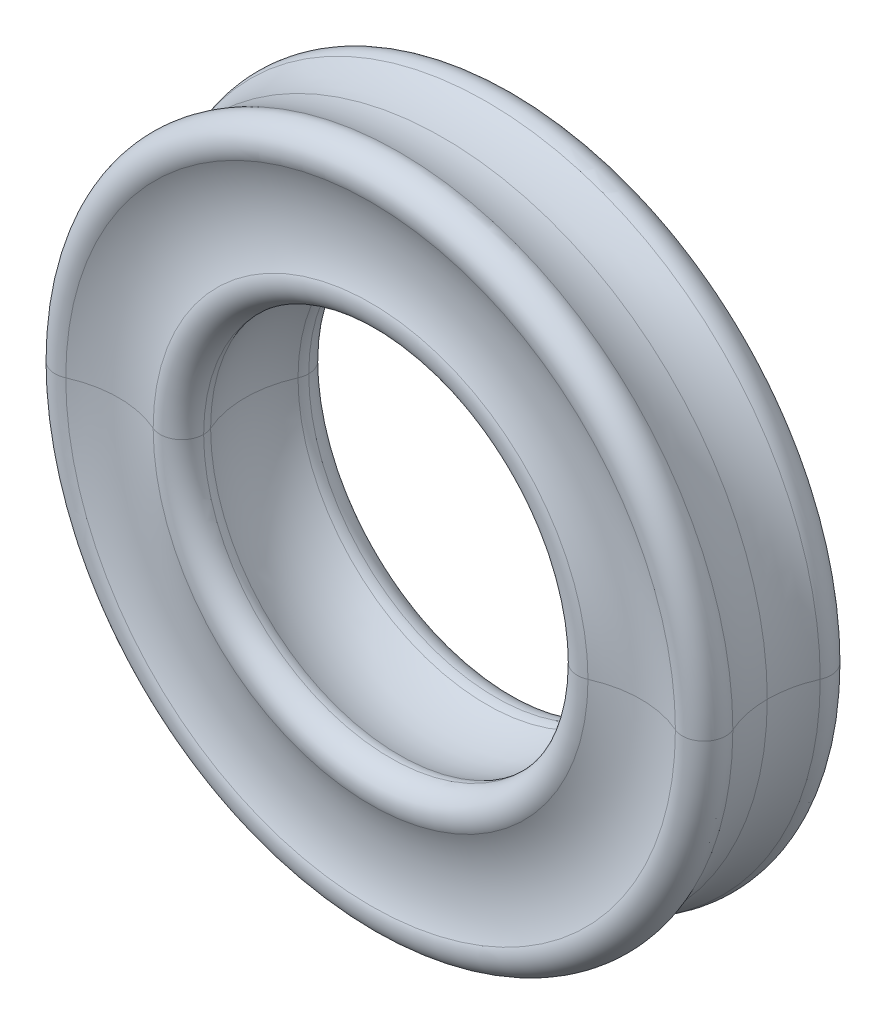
ISO-10303-21;
HEADER;
FILE_DESCRIPTION(('STEP AP214'),'2;1');
FILE_NAME('part.step','',(''),(''),'','','');
FILE_SCHEMA(('AUTOMOTIVE_DESIGN { 1 0 10303 214 1 1 1 1 }'));
ENDSEC;
DATA;
#1=APPLICATION_CONTEXT('core data for automotive mechanical design processes');
#2=APPLICATION_PROTOCOL_DEFINITION('international standard','automotive_design',2000,#1);
#3=PRODUCT_CONTEXT('',#1,'mechanical');
#4=PRODUCT('Part','Part','',(#3));
#5=PRODUCT_RELATED_PRODUCT_CATEGORY('part','',(#4));
#6=PRODUCT_DEFINITION_FORMATION('','',#4);
#7=PRODUCT_DEFINITION_CONTEXT('part definition',#1,'design');
#8=PRODUCT_DEFINITION('design','',#6,#7);
#9=PRODUCT_DEFINITION_SHAPE('','',#8);
#10=(LENGTH_UNIT() NAMED_UNIT(*) SI_UNIT(.MILLI.,.METRE.));
#11=(NAMED_UNIT(*) PLANE_ANGLE_UNIT() SI_UNIT($,.RADIAN.));
#12=(NAMED_UNIT(*) SI_UNIT($,.STERADIAN.) SOLID_ANGLE_UNIT());
#13=UNCERTAINTY_MEASURE_WITH_UNIT(LENGTH_MEASURE(1.E-05),#10,'distance_accuracy_value','');
#14=(GEOMETRIC_REPRESENTATION_CONTEXT(3) GLOBAL_UNCERTAINTY_ASSIGNED_CONTEXT((#13)) GLOBAL_UNIT_ASSIGNED_CONTEXT((#10,
#11,#12)) REPRESENTATION_CONTEXT('',''));
#15=CARTESIAN_POINT('',(0.,0.,0.));
#16=DIRECTION('',(0.,0.,1.));
#17=DIRECTION('',(1.,0.,0.));
#18=AXIS2_PLACEMENT_3D('',#15,#16,#17);
#19=CARTESIAN_POINT('',(0.,0.,-0.628617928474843));
#20=DIRECTION('',(0.,0.,1.));
#21=DIRECTION('',(1.,0.,0.));
#22=AXIS2_PLACEMENT_3D('',#19,#20,#21);
#23=TOROIDAL_SURFACE('',#22,2.49558207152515,0.260382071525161);
#24=CARTESIAN_POINT('',(0.,0.,-0.628617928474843));
#25=DIRECTION('',(0.,0.,1.));
#26=DIRECTION('',(1.,0.,0.));
#27=AXIS2_PLACEMENT_3D('',#24,#25,#26);
#28=CIRCLE('',#27,2.2352);
#29=CARTESIAN_POINT('',(-2.2352,0.,-0.628617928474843));
#30=VERTEX_POINT('',#29);
#31=CARTESIAN_POINT('',(2.2352,0.,-0.628617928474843));
#32=VERTEX_POINT('',#31);
#33=EDGE_CURVE('E193',#30,#32,#28,.T.);
#34=ORIENTED_EDGE('',*,*,#33,.F.);
#35=CARTESIAN_POINT('',(-2.49558207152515,0.,-0.628617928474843));
#36=DIRECTION('',(0.,1.,0.));
#37=DIRECTION('',(-1.,0.,0.));
#38=AXIS2_PLACEMENT_3D('',#35,#36,#37);
#39=CIRCLE('',#38,0.260382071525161);
#40=CARTESIAN_POINT('',(-2.25762525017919,0.,-0.522904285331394));
#41=VERTEX_POINT('',#40);
#42=EDGE_CURVE('E153',#41,#30,#39,.T.);
#43=ORIENTED_EDGE('',*,*,#42,.F.);
#44=CARTESIAN_POINT('',(0.,0.,-0.522904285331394));
#45=DIRECTION('',(0.,0.,1.));
#46=DIRECTION('',(1.,0.,0.));
#47=AXIS2_PLACEMENT_3D('',#44,#45,#46);
#48=CIRCLE('',#47,2.25762525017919);
#49=CARTESIAN_POINT('',(2.25762525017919,0.,-0.522904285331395));
#50=VERTEX_POINT('',#49);
#51=EDGE_CURVE('E147',#41,#50,#48,.T.);
#52=ORIENTED_EDGE('',*,*,#51,.T.);
#53=CARTESIAN_POINT('',(2.49558207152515,0.,-0.628617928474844));
#54=DIRECTION('',(0.,-1.,0.));
#55=DIRECTION('',(0.,0.,-1.));
#56=AXIS2_PLACEMENT_3D('',#53,#54,#55);
#57=CIRCLE('',#56,0.260382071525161);
#58=EDGE_CURVE('E154',#50,#32,#57,.T.);
#59=ORIENTED_EDGE('',*,*,#58,.T.);
#60=EDGE_LOOP('',(#34,#43,#52,#59));
#61=FACE_BOUND('',#60,.T.);
#62=ADVANCED_FACE('F16',(#61),#23,.T.);
#63=CARTESIAN_POINT('',(0.,0.,0.));
#64=DIRECTION('',(0.,0.,1.));
#65=DIRECTION('',(1.,0.,0.));
#66=AXIS2_PLACEMENT_3D('',#63,#64,#65);
#67=DEGENERATE_TOROIDAL_SURFACE('',#66,1.08059040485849,1.2879595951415,.T.);
#68=CARTESIAN_POINT('',(-1.08059040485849,0.,0.));
#69=DIRECTION('',(0.,1.,0.));
#70=DIRECTION('',(-1.,0.,0.));
#71=AXIS2_PLACEMENT_3D('',#68,#69,#70);
#72=CIRCLE('',#71,1.2879595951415);
#73=CARTESIAN_POINT('',(-2.25762525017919,0.,0.522904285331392));
#74=VERTEX_POINT('',#73);
#75=EDGE_CURVE('E102',#41,#74,#72,.T.);
#76=ORIENTED_EDGE('',*,*,#75,.F.);
#77=CARTESIAN_POINT('',(0.,0.,-0.522904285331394));
#78=DIRECTION('',(0.,0.,1.));
#79=DIRECTION('',(1.,0.,0.));
#80=AXIS2_PLACEMENT_3D('',#77,#78,#79);
#81=CIRCLE('',#80,2.25762525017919);
#82=EDGE_CURVE('E94',#50,#41,#81,.T.);
#83=ORIENTED_EDGE('',*,*,#82,.F.);
#84=CARTESIAN_POINT('',(1.08059040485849,0.,0.));
#85=DIRECTION('',(0.,-1.,0.));
#86=DIRECTION('',(0.,0.,-1.));
#87=AXIS2_PLACEMENT_3D('',#84,#85,#86);
#88=CIRCLE('',#87,1.2879595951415);
#89=CARTESIAN_POINT('',(2.25762525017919,0.,0.522904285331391));
#90=VERTEX_POINT('',#89);
#91=EDGE_CURVE('E87',#50,#90,#88,.T.);
#92=ORIENTED_EDGE('',*,*,#91,.T.);
#93=CARTESIAN_POINT('',(0.,0.,0.522904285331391));
#94=DIRECTION('',(0.,0.,1.));
#95=DIRECTION('',(1.,0.,0.));
#96=AXIS2_PLACEMENT_3D('',#93,#94,#95);
#97=CIRCLE('',#96,2.25762525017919);
#98=EDGE_CURVE('E91',#90,#74,#97,.T.);
#99=ORIENTED_EDGE('',*,*,#98,.T.);
#100=EDGE_LOOP('',(#76,#83,#92,#99));
#101=FACE_BOUND('',#100,.T.);
#102=ADVANCED_FACE('F90',(#101),#67,.F.);
#103=CARTESIAN_POINT('',(0.,0.,0.628617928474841));
#104=DIRECTION('',(0.,0.,1.));
#105=DIRECTION('',(1.,0.,0.));
#106=AXIS2_PLACEMENT_3D('',#103,#104,#105);
#107=TOROIDAL_SURFACE('',#106,2.49558207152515,0.260382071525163);
#108=CARTESIAN_POINT('',(0.,0.,0.628617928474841));
#109=DIRECTION('',(0.,0.,1.));
#110=DIRECTION('',(1.,0.,0.));
#111=AXIS2_PLACEMENT_3D('',#108,#109,#110);
#112=CIRCLE('',#111,2.2352);
#113=CARTESIAN_POINT('',(-2.2352,0.,0.628617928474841));
#114=VERTEX_POINT('',#113);
#115=CARTESIAN_POINT('',(2.2352,0.,0.628617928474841));
#116=VERTEX_POINT('',#115);
#117=EDGE_CURVE('E127',#114,#116,#112,.T.);
#118=ORIENTED_EDGE('',*,*,#117,.F.);
#119=CARTESIAN_POINT('',(-2.49558207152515,0.,0.628617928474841));
#120=DIRECTION('',(0.,1.,0.));
#121=DIRECTION('',(-1.,0.,0.));
#122=AXIS2_PLACEMENT_3D('',#119,#120,#121);
#123=CIRCLE('',#122,0.260382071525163);
#124=CARTESIAN_POINT('',(-2.6012957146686,0.,0.866574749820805));
#125=VERTEX_POINT('',#124);
#126=EDGE_CURVE('E20',#125,#114,#123,.T.);
#127=ORIENTED_EDGE('',*,*,#126,.F.);
#128=CARTESIAN_POINT('',(0.,0.,0.866574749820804));
#129=DIRECTION('',(0.,0.,1.));
#130=DIRECTION('',(1.,0.,0.));
#131=AXIS2_PLACEMENT_3D('',#128,#129,#130);
#132=CIRCLE('',#131,2.6012957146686);
#133=CARTESIAN_POINT('',(2.6012957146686,0.,0.866574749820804));
#134=VERTEX_POINT('',#133);
#135=EDGE_CURVE('E138',#125,#134,#132,.T.);
#136=ORIENTED_EDGE('',*,*,#135,.T.);
#137=CARTESIAN_POINT('',(2.49558207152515,0.,0.62861792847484));
#138=DIRECTION('',(0.,-1.,0.));
#139=DIRECTION('',(0.,0.,-1.));
#140=AXIS2_PLACEMENT_3D('',#137,#138,#139);
#141=CIRCLE('',#140,0.260382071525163);
#142=EDGE_CURVE('E101',#134,#116,#141,.T.);
#143=ORIENTED_EDGE('',*,*,#142,.T.);
#144=EDGE_LOOP('',(#118,#127,#136,#143));
#145=FACE_BOUND('',#144,.T.);
#146=ADVANCED_FACE('F267',(#145),#107,.T.);
#147=CARTESIAN_POINT('',(0.,0.,2.0436095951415));
#148=DIRECTION('',(0.,0.,1.));
#149=DIRECTION('',(1.,0.,0.));
#150=AXIS2_PLACEMENT_3D('',#147,#148,#149);
#151=TOROIDAL_SURFACE('',#150,3.1242,1.2879595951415);
#152=CARTESIAN_POINT('',(-3.1242,0.,2.0436095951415));
#153=DIRECTION('',(0.,1.,0.));
#154=DIRECTION('',(-1.,0.,0.));
#155=AXIS2_PLACEMENT_3D('',#152,#153,#154);
#156=CIRCLE('',#155,1.2879595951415);
#157=CARTESIAN_POINT('',(-3.64710428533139,0.,0.866574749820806));
#158=VERTEX_POINT('',#157);
#159=EDGE_CURVE('E184',#125,#158,#156,.T.);
#160=ORIENTED_EDGE('',*,*,#159,.F.);
#161=CARTESIAN_POINT('',(0.,0.,0.866574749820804));
#162=DIRECTION('',(0.,0.,1.));
#163=DIRECTION('',(1.,0.,0.));
#164=AXIS2_PLACEMENT_3D('',#161,#162,#163);
#165=CIRCLE('',#164,2.6012957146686);
#166=EDGE_CURVE('E169',#134,#125,#165,.T.);
#167=ORIENTED_EDGE('',*,*,#166,.F.);
#168=CARTESIAN_POINT('',(3.1242,0.,2.0436095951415));
#169=DIRECTION('',(0.,-1.,0.));
#170=DIRECTION('',(0.,0.,-1.));
#171=AXIS2_PLACEMENT_3D('',#168,#169,#170);
#172=CIRCLE('',#171,1.2879595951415);
#173=CARTESIAN_POINT('',(3.64710428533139,0.,0.866574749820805));
#174=VERTEX_POINT('',#173);
#175=EDGE_CURVE('E144',#134,#174,#172,.T.);
#176=ORIENTED_EDGE('',*,*,#175,.T.);
#177=CARTESIAN_POINT('',(0.,0.,0.866574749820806));
#178=DIRECTION('',(0.,0.,1.));
#179=DIRECTION('',(1.,0.,0.));
#180=AXIS2_PLACEMENT_3D('',#177,#178,#179);
#181=CIRCLE('',#180,3.64710428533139);
#182=EDGE_CURVE('E143',#174,#158,#181,.T.);
#183=ORIENTED_EDGE('',*,*,#182,.T.);
#184=EDGE_LOOP('',(#160,#167,#176,#183));
#185=FACE_BOUND('',#184,.T.);
#186=ADVANCED_FACE('F276',(#185),#151,.F.);
#187=CARTESIAN_POINT('',(0.,0.,0.628617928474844));
#188=DIRECTION('',(0.,0.,1.));
#189=DIRECTION('',(1.,0.,0.));
#190=AXIS2_PLACEMENT_3D('',#187,#188,#189);
#191=TOROIDAL_SURFACE('',#190,3.75281792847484,0.260382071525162);
#192=CARTESIAN_POINT('',(-3.75281792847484,0.,0.628617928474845));
#193=DIRECTION('',(0.,1.,0.));
#194=DIRECTION('',(-1.,0.,0.));
#195=AXIS2_PLACEMENT_3D('',#192,#193,#194);
#196=CIRCLE('',#195,0.260382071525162);
#197=CARTESIAN_POINT('',(-3.9907747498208,0.,0.522904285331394));
#198=VERTEX_POINT('',#197);
#199=EDGE_CURVE('E140',#198,#158,#196,.T.);
#200=ORIENTED_EDGE('',*,*,#199,.F.);
#201=CARTESIAN_POINT('',(0.,0.,0.522904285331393));
#202=DIRECTION('',(0.,0.,1.));
#203=DIRECTION('',(1.,0.,0.));
#204=AXIS2_PLACEMENT_3D('',#201,#202,#203);
#205=CIRCLE('',#204,3.9907747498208);
#206=CARTESIAN_POINT('',(3.9907747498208,0.,0.522904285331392));
#207=VERTEX_POINT('',#206);
#208=EDGE_CURVE('E170',#198,#207,#205,.T.);
#209=ORIENTED_EDGE('',*,*,#208,.T.);
#210=CARTESIAN_POINT('',(3.75281792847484,0.,0.628617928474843));
#211=DIRECTION('',(0.,-1.,0.));
#212=DIRECTION('',(0.,0.,-1.));
#213=AXIS2_PLACEMENT_3D('',#210,#211,#212);
#214=CIRCLE('',#213,0.260382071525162);
#215=EDGE_CURVE('E148',#207,#174,#214,.T.);
#216=ORIENTED_EDGE('',*,*,#215,.T.);
#217=CARTESIAN_POINT('',(0.,0.,0.866574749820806));
#218=DIRECTION('',(0.,0.,1.));
#219=DIRECTION('',(1.,0.,0.));
#220=AXIS2_PLACEMENT_3D('',#217,#218,#219);
#221=CIRCLE('',#220,3.64710428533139);
#222=EDGE_CURVE('E180',#158,#174,#221,.T.);
#223=ORIENTED_EDGE('',*,*,#222,.F.);
#224=EDGE_LOOP('',(#200,#209,#216,#223));
#225=FACE_BOUND('',#224,.T.);
#226=ADVANCED_FACE('F446',(#225),#191,.T.);
#227=CARTESIAN_POINT('',(0.,0.,0.));
#228=DIRECTION('',(0.,0.,1.));
#229=DIRECTION('',(1.,0.,0.));
#230=AXIS2_PLACEMENT_3D('',#227,#228,#229);
#231=TOROIDAL_SURFACE('',#230,5.1678095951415,1.2879595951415);
#232=CARTESIAN_POINT('',(0.,0.,0.));
#233=DIRECTION('',(0.,0.,1.));
#234=DIRECTION('',(1.,0.,0.));
#235=AXIS2_PLACEMENT_3D('',#232,#233,#234);
#236=CIRCLE('',#235,3.87985);
#237=CARTESIAN_POINT('',(3.87985,0.,0.));
#238=VERTEX_POINT('',#237);
#239=CARTESIAN_POINT('',(-3.87985,0.,0.));
#240=VERTEX_POINT('',#239);
#241=EDGE_CURVE('E161',#238,#240,#236,.T.);
#242=ORIENTED_EDGE('',*,*,#241,.F.);
#243=CARTESIAN_POINT('',(5.1678095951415,0.,0.));
#244=DIRECTION('',(0.,-1.,0.));
#245=DIRECTION('',(0.,0.,-1.));
#246=AXIS2_PLACEMENT_3D('',#243,#244,#245);
#247=CIRCLE('',#246,1.2879595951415);
#248=CARTESIAN_POINT('',(3.9907747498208,0.,-0.522904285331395));
#249=VERTEX_POINT('',#248);
#250=EDGE_CURVE('E166',#238,#249,#247,.T.);
#251=ORIENTED_EDGE('',*,*,#250,.T.);
#252=CARTESIAN_POINT('',(0.,0.,-0.522904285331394));
#253=DIRECTION('',(0.,0.,1.));
#254=DIRECTION('',(1.,0.,0.));
#255=AXIS2_PLACEMENT_3D('',#252,#253,#254);
#256=CIRCLE('',#255,3.9907747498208);
#257=CARTESIAN_POINT('',(-3.9907747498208,0.,-0.522904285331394));
#258=VERTEX_POINT('',#257);
#259=EDGE_CURVE('E213',#249,#258,#256,.T.);
#260=ORIENTED_EDGE('',*,*,#259,.T.);
#261=CARTESIAN_POINT('',(-5.1678095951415,0.,0.));
#262=DIRECTION('',(0.,1.,0.));
#263=DIRECTION('',(-1.,0.,0.));
#264=AXIS2_PLACEMENT_3D('',#261,#262,#263);
#265=CIRCLE('',#264,1.2879595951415);
#266=EDGE_CURVE('E151',#240,#258,#265,.T.);
#267=ORIENTED_EDGE('',*,*,#266,.F.);
#268=EDGE_LOOP('',(#242,#251,#260,#267));
#269=FACE_BOUND('',#268,.T.);
#270=ADVANCED_FACE('F18',(#269),#231,.F.);
#271=CARTESIAN_POINT('',(0.,0.,-0.628617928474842));
#272=DIRECTION('',(0.,0.,1.));
#273=DIRECTION('',(1.,0.,0.));
#274=AXIS2_PLACEMENT_3D('',#271,#272,#273);
#275=TOROIDAL_SURFACE('',#274,3.75281792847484,0.260382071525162);
#276=CARTESIAN_POINT('',(-3.75281792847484,0.,-0.628617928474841));
#277=DIRECTION('',(0.,1.,0.));
#278=DIRECTION('',(-1.,0.,0.));
#279=AXIS2_PLACEMENT_3D('',#276,#277,#278);
#280=CIRCLE('',#279,0.260382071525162);
#281=CARTESIAN_POINT('',(-3.64710428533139,0.,-0.866574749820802));
#282=VERTEX_POINT('',#281);
#283=EDGE_CURVE('E217',#282,#258,#280,.T.);
#284=ORIENTED_EDGE('',*,*,#283,.F.);
#285=CARTESIAN_POINT('',(0.,0.,-0.866574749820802));
#286=DIRECTION('',(0.,0.,1.));
#287=DIRECTION('',(1.,0.,0.));
#288=AXIS2_PLACEMENT_3D('',#285,#286,#287);
#289=CIRCLE('',#288,3.64710428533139);
#290=CARTESIAN_POINT('',(3.64710428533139,0.,-0.866574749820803));
#291=VERTEX_POINT('',#290);
#292=EDGE_CURVE('E212',#282,#291,#289,.T.);
#293=ORIENTED_EDGE('',*,*,#292,.T.);
#294=CARTESIAN_POINT('',(3.75281792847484,0.,-0.628617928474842));
#295=DIRECTION('',(0.,-1.,0.));
#296=DIRECTION('',(0.,0.,-1.));
#297=AXIS2_PLACEMENT_3D('',#294,#295,#296);
#298=CIRCLE('',#297,0.260382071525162);
#299=EDGE_CURVE('E208',#291,#249,#298,.T.);
#300=ORIENTED_EDGE('',*,*,#299,.T.);
#301=CARTESIAN_POINT('',(0.,0.,-0.522904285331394));
#302=DIRECTION('',(0.,0.,1.));
#303=DIRECTION('',(1.,0.,0.));
#304=AXIS2_PLACEMENT_3D('',#301,#302,#303);
#305=CIRCLE('',#304,3.9907747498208);
#306=EDGE_CURVE('E162',#258,#249,#305,.T.);
#307=ORIENTED_EDGE('',*,*,#306,.F.);
#308=EDGE_LOOP('',(#284,#293,#300,#307));
#309=FACE_BOUND('',#308,.T.);
#310=ADVANCED_FACE('F305',(#309),#275,.T.);
#311=CARTESIAN_POINT('',(0.,0.,-2.0436095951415));
#312=DIRECTION('',(0.,0.,1.));
#313=DIRECTION('',(1.,0.,0.));
#314=AXIS2_PLACEMENT_3D('',#311,#312,#313);
#315=TOROIDAL_SURFACE('',#314,3.1242,1.2879595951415);
#316=CARTESIAN_POINT('',(-3.1242,0.,-2.0436095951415));
#317=DIRECTION('',(0.,1.,0.));
#318=DIRECTION('',(-1.,0.,0.));
#319=AXIS2_PLACEMENT_3D('',#316,#317,#318);
#320=CIRCLE('',#319,1.2879595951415);
#321=CARTESIAN_POINT('',(-2.60129571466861,0.,-0.866574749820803));
#322=VERTEX_POINT('',#321);
#323=EDGE_CURVE('E27',#282,#322,#320,.T.);
#324=ORIENTED_EDGE('',*,*,#323,.F.);
#325=CARTESIAN_POINT('',(0.,0.,-0.866574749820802));
#326=DIRECTION('',(0.,0.,1.));
#327=DIRECTION('',(1.,0.,0.));
#328=AXIS2_PLACEMENT_3D('',#325,#326,#327);
#329=CIRCLE('',#328,3.64710428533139);
#330=EDGE_CURVE('E192',#291,#282,#329,.T.);
#331=ORIENTED_EDGE('',*,*,#330,.F.);
#332=CARTESIAN_POINT('',(3.1242,0.,-2.0436095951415));
#333=DIRECTION('',(0.,-1.,0.));
#334=DIRECTION('',(0.,0.,-1.));
#335=AXIS2_PLACEMENT_3D('',#332,#333,#334);
#336=CIRCLE('',#335,1.2879595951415);
#337=CARTESIAN_POINT('',(2.60129571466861,0.,-0.866574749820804));
#338=VERTEX_POINT('',#337);
#339=EDGE_CURVE('E11',#291,#338,#336,.T.);
#340=ORIENTED_EDGE('',*,*,#339,.T.);
#341=CARTESIAN_POINT('',(0.,0.,-0.866574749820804));
#342=DIRECTION('',(0.,0.,1.));
#343=DIRECTION('',(1.,0.,0.));
#344=AXIS2_PLACEMENT_3D('',#341,#342,#343);
#345=CIRCLE('',#344,2.60129571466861);
#346=EDGE_CURVE('E188',#338,#322,#345,.T.);
#347=ORIENTED_EDGE('',*,*,#346,.T.);
#348=EDGE_LOOP('',(#324,#331,#340,#347));
#349=FACE_BOUND('',#348,.T.);
#350=ADVANCED_FACE('F340',(#349),#315,.F.);
#351=CARTESIAN_POINT('',(0.,0.,-2.0436095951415));
#352=DIRECTION('',(0.,0.,1.));
#353=DIRECTION('',(1.,0.,0.));
#354=AXIS2_PLACEMENT_3D('',#351,#352,#353);
#355=TOROIDAL_SURFACE('',#354,3.1242,1.2879595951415);
#356=ORIENTED_EDGE('',*,*,#292,.F.);
#357=ORIENTED_EDGE('',*,*,#323,.T.);
#358=CARTESIAN_POINT('',(0.,0.,-0.866574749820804));
#359=DIRECTION('',(0.,0.,1.));
#360=DIRECTION('',(1.,0.,0.));
#361=AXIS2_PLACEMENT_3D('',#358,#359,#360);
#362=CIRCLE('',#361,2.60129571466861);
#363=EDGE_CURVE('E221',#322,#338,#362,.T.);
#364=ORIENTED_EDGE('',*,*,#363,.T.);
#365=ORIENTED_EDGE('',*,*,#339,.F.);
#366=EDGE_LOOP('',(#356,#357,#364,#365));
#367=FACE_BOUND('',#366,.T.);
#368=ADVANCED_FACE('F333',(#367),#355,.F.);
#369=CARTESIAN_POINT('',(0.,0.,-0.628617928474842));
#370=DIRECTION('',(0.,0.,1.));
#371=DIRECTION('',(1.,0.,0.));
#372=AXIS2_PLACEMENT_3D('',#369,#370,#371);
#373=TOROIDAL_SURFACE('',#372,3.75281792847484,0.260382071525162);
#374=ORIENTED_EDGE('',*,*,#330,.T.);
#375=ORIENTED_EDGE('',*,*,#283,.T.);
#376=ORIENTED_EDGE('',*,*,#259,.F.);
#377=ORIENTED_EDGE('',*,*,#299,.F.);
#378=EDGE_LOOP('',(#374,#375,#376,#377));
#379=FACE_BOUND('',#378,.T.);
#380=ADVANCED_FACE('F302',(#379),#373,.T.);
#381=CARTESIAN_POINT('',(0.,0.,0.));
#382=DIRECTION('',(0.,0.,1.));
#383=DIRECTION('',(1.,0.,0.));
#384=AXIS2_PLACEMENT_3D('',#381,#382,#383);
#385=TOROIDAL_SURFACE('',#384,5.1678095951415,1.2879595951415);
#386=CARTESIAN_POINT('',(0.,0.,0.));
#387=DIRECTION('',(0.,0.,1.));
#388=DIRECTION('',(1.,0.,0.));
#389=AXIS2_PLACEMENT_3D('',#386,#387,#388);
#390=CIRCLE('',#389,3.87985);
#391=EDGE_CURVE('E174',#240,#238,#390,.T.);
#392=ORIENTED_EDGE('',*,*,#391,.F.);
#393=ORIENTED_EDGE('',*,*,#266,.T.);
#394=ORIENTED_EDGE('',*,*,#306,.T.);
#395=ORIENTED_EDGE('',*,*,#250,.F.);
#396=EDGE_LOOP('',(#392,#393,#394,#395));
#397=FACE_BOUND('',#396,.T.);
#398=ADVANCED_FACE('F307',(#397),#385,.F.);
#399=CARTESIAN_POINT('',(0.,0.,0.628617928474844));
#400=DIRECTION('',(0.,0.,1.));
#401=DIRECTION('',(1.,0.,0.));
#402=AXIS2_PLACEMENT_3D('',#399,#400,#401);
#403=TOROIDAL_SURFACE('',#402,3.75281792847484,0.260382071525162);
#404=CARTESIAN_POINT('',(0.,0.,0.522904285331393));
#405=DIRECTION('',(0.,0.,1.));
#406=DIRECTION('',(1.,0.,0.));
#407=AXIS2_PLACEMENT_3D('',#404,#405,#406);
#408=CIRCLE('',#407,3.9907747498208);
#409=EDGE_CURVE('E160',#207,#198,#408,.T.);
#410=ORIENTED_EDGE('',*,*,#409,.T.);
#411=ORIENTED_EDGE('',*,*,#199,.T.);
#412=ORIENTED_EDGE('',*,*,#182,.F.);
#413=ORIENTED_EDGE('',*,*,#215,.F.);
#414=EDGE_LOOP('',(#410,#411,#412,#413));
#415=FACE_BOUND('',#414,.T.);
#416=ADVANCED_FACE('F444',(#415),#403,.T.);
#417=CARTESIAN_POINT('',(0.,0.,2.0436095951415));
#418=DIRECTION('',(0.,0.,1.));
#419=DIRECTION('',(1.,0.,0.));
#420=AXIS2_PLACEMENT_3D('',#417,#418,#419);
#421=TOROIDAL_SURFACE('',#420,3.1242,1.2879595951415);
#422=ORIENTED_EDGE('',*,*,#135,.F.);
#423=ORIENTED_EDGE('',*,*,#159,.T.);
#424=ORIENTED_EDGE('',*,*,#222,.T.);
#425=ORIENTED_EDGE('',*,*,#175,.F.);
#426=EDGE_LOOP('',(#422,#423,#424,#425));
#427=FACE_BOUND('',#426,.T.);
#428=ADVANCED_FACE('F447',(#427),#421,.F.);
#429=CARTESIAN_POINT('',(0.,0.,0.628617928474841));
#430=DIRECTION('',(0.,0.,1.));
#431=DIRECTION('',(1.,0.,0.));
#432=AXIS2_PLACEMENT_3D('',#429,#430,#431);
#433=TOROIDAL_SURFACE('',#432,2.49558207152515,0.260382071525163);
#434=CARTESIAN_POINT('',(0.,0.,0.628617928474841));
#435=DIRECTION('',(0.,0.,1.));
#436=DIRECTION('',(1.,0.,0.));
#437=AXIS2_PLACEMENT_3D('',#434,#435,#436);
#438=CIRCLE('',#437,2.2352);
#439=EDGE_CURVE('E116',#116,#114,#438,.T.);
#440=ORIENTED_EDGE('',*,*,#439,.F.);
#441=ORIENTED_EDGE('',*,*,#142,.F.);
#442=ORIENTED_EDGE('',*,*,#166,.T.);
#443=ORIENTED_EDGE('',*,*,#126,.T.);
#444=EDGE_LOOP('',(#440,#441,#442,#443));
#445=FACE_BOUND('',#444,.T.);
#446=ADVANCED_FACE('F277',(#445),#433,.T.);
#447=CARTESIAN_POINT('',(0.,0.,0.));
#448=DIRECTION('',(0.,0.,1.));
#449=DIRECTION('',(1.,0.,0.));
#450=AXIS2_PLACEMENT_3D('',#447,#448,#449);
#451=DEGENERATE_TOROIDAL_SURFACE('',#450,1.08059040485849,1.2879595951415,.T.);
#452=ORIENTED_EDGE('',*,*,#51,.F.);
#453=ORIENTED_EDGE('',*,*,#75,.T.);
#454=CARTESIAN_POINT('',(0.,0.,0.522904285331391));
#455=DIRECTION('',(0.,0.,1.));
#456=DIRECTION('',(1.,0.,0.));
#457=AXIS2_PLACEMENT_3D('',#454,#455,#456);
#458=CIRCLE('',#457,2.25762525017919);
#459=EDGE_CURVE('E119',#74,#90,#458,.T.);
#460=ORIENTED_EDGE('',*,*,#459,.T.);
#461=ORIENTED_EDGE('',*,*,#91,.F.);
#462=EDGE_LOOP('',(#452,#453,#460,#461));
#463=FACE_BOUND('',#462,.T.);
#464=ADVANCED_FACE('F120',(#463),#451,.F.);
#465=CARTESIAN_POINT('',(0.,0.,-0.628617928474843));
#466=DIRECTION('',(0.,0.,1.));
#467=DIRECTION('',(1.,0.,0.));
#468=AXIS2_PLACEMENT_3D('',#465,#466,#467);
#469=TOROIDAL_SURFACE('',#468,2.49558207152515,0.260382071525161);
#470=CARTESIAN_POINT('',(0.,0.,-0.628617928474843));
#471=DIRECTION('',(0.,0.,1.));
#472=DIRECTION('',(1.,0.,0.));
#473=AXIS2_PLACEMENT_3D('',#470,#471,#472);
#474=CIRCLE('',#473,2.2352);
#475=EDGE_CURVE('E115',#32,#30,#474,.T.);
#476=ORIENTED_EDGE('',*,*,#475,.F.);
#477=ORIENTED_EDGE('',*,*,#58,.F.);
#478=ORIENTED_EDGE('',*,*,#82,.T.);
#479=ORIENTED_EDGE('',*,*,#42,.T.);
#480=EDGE_LOOP('',(#476,#477,#478,#479));
#481=FACE_BOUND('',#480,.T.);
#482=ADVANCED_FACE('F466',(#481),#469,.T.);
#483=CARTESIAN_POINT('',(0.,0.,-0.628617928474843));
#484=DIRECTION('',(0.,0.,1.));
#485=DIRECTION('',(1.,0.,0.));
#486=AXIS2_PLACEMENT_3D('',#483,#484,#485);
#487=TOROIDAL_SURFACE('',#486,2.49558207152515,0.260382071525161);
#488=CARTESIAN_POINT('',(2.49558207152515,0.,-0.628617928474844));
#489=DIRECTION('',(0.,-1.,0.));
#490=DIRECTION('',(0.,0.,-1.));
#491=AXIS2_PLACEMENT_3D('',#488,#489,#490);
#492=CIRCLE('',#491,0.260382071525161);
#493=EDGE_CURVE('E196',#32,#338,#492,.T.);
#494=ORIENTED_EDGE('',*,*,#493,.F.);
#495=ORIENTED_EDGE('',*,*,#475,.T.);
#496=CARTESIAN_POINT('',(-2.49558207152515,0.,-0.628617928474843));
#497=DIRECTION('',(0.,1.,0.));
#498=DIRECTION('',(-1.,0.,0.));
#499=AXIS2_PLACEMENT_3D('',#496,#497,#498);
#500=CIRCLE('',#499,0.260382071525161);
#501=EDGE_CURVE('E197',#30,#322,#500,.T.);
#502=ORIENTED_EDGE('',*,*,#501,.T.);
#503=ORIENTED_EDGE('',*,*,#346,.F.);
#504=EDGE_LOOP('',(#494,#495,#502,#503));
#505=FACE_BOUND('',#504,.T.);
#506=ADVANCED_FACE('F346',(#505),#487,.T.);
#507=CARTESIAN_POINT('',(0.,0.,0.628617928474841));
#508=DIRECTION('',(0.,0.,1.));
#509=DIRECTION('',(1.,0.,0.));
#510=AXIS2_PLACEMENT_3D('',#507,#508,#509);
#511=TOROIDAL_SURFACE('',#510,2.49558207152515,0.260382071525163);
#512=CARTESIAN_POINT('',(2.49558207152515,0.,0.62861792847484));
#513=DIRECTION('',(0.,-1.,0.));
#514=DIRECTION('',(0.,0.,-1.));
#515=AXIS2_PLACEMENT_3D('',#512,#513,#514);
#516=CIRCLE('',#515,0.260382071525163);
#517=EDGE_CURVE('E110',#116,#90,#516,.T.);
#518=ORIENTED_EDGE('',*,*,#517,.F.);
#519=ORIENTED_EDGE('',*,*,#439,.T.);
#520=CARTESIAN_POINT('',(-2.49558207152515,0.,0.628617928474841));
#521=DIRECTION('',(0.,1.,0.));
#522=DIRECTION('',(-1.,0.,0.));
#523=AXIS2_PLACEMENT_3D('',#520,#521,#522);
#524=CIRCLE('',#523,0.260382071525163);
#525=EDGE_CURVE('E113',#114,#74,#524,.T.);
#526=ORIENTED_EDGE('',*,*,#525,.T.);
#527=ORIENTED_EDGE('',*,*,#98,.F.);
#528=EDGE_LOOP('',(#518,#519,#526,#527));
#529=FACE_BOUND('',#528,.T.);
#530=ADVANCED_FACE('F107',(#529),#511,.T.);
#531=CARTESIAN_POINT('',(0.,0.,0.));
#532=DIRECTION('',(0.,0.,1.));
#533=DIRECTION('',(1.,0.,0.));
#534=AXIS2_PLACEMENT_3D('',#531,#532,#533);
#535=TOROIDAL_SURFACE('',#534,5.1678095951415,1.2879595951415);
#536=CARTESIAN_POINT('',(-5.1678095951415,0.,0.));
#537=DIRECTION('',(0.,1.,0.));
#538=DIRECTION('',(-1.,0.,0.));
#539=AXIS2_PLACEMENT_3D('',#536,#537,#538);
#540=CIRCLE('',#539,1.2879595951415);
#541=EDGE_CURVE('E156',#198,#240,#540,.T.);
#542=ORIENTED_EDGE('',*,*,#541,.T.);
#543=ORIENTED_EDGE('',*,*,#391,.T.);
#544=CARTESIAN_POINT('',(5.1678095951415,0.,0.));
#545=DIRECTION('',(0.,-1.,0.));
#546=DIRECTION('',(0.,0.,-1.));
#547=AXIS2_PLACEMENT_3D('',#544,#545,#546);
#548=CIRCLE('',#547,1.2879595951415);
#549=EDGE_CURVE('E123',#207,#238,#548,.T.);
#550=ORIENTED_EDGE('',*,*,#549,.F.);
#551=ORIENTED_EDGE('',*,*,#208,.F.);
#552=EDGE_LOOP('',(#542,#543,#550,#551));
#553=FACE_BOUND('',#552,.T.);
#554=ADVANCED_FACE('F315',(#553),#535,.F.);
#555=CARTESIAN_POINT('',(0.,0.,0.));
#556=DIRECTION('',(0.,0.,1.));
#557=DIRECTION('',(1.,0.,0.));
#558=AXIS2_PLACEMENT_3D('',#555,#556,#557);
#559=TOROIDAL_SURFACE('',#558,5.1678095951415,1.2879595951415);
#560=ORIENTED_EDGE('',*,*,#549,.T.);
#561=ORIENTED_EDGE('',*,*,#241,.T.);
#562=ORIENTED_EDGE('',*,*,#541,.F.);
#563=ORIENTED_EDGE('',*,*,#409,.F.);
#564=EDGE_LOOP('',(#560,#561,#562,#563));
#565=FACE_BOUND('',#564,.T.);
#566=ADVANCED_FACE('F318',(#565),#559,.F.);
#567=CARTESIAN_POINT('',(0.,0.,0.628617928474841));
#568=DIRECTION('',(0.,0.,1.));
#569=DIRECTION('',(1.,0.,0.));
#570=AXIS2_PLACEMENT_3D('',#567,#568,#569);
#571=TOROIDAL_SURFACE('',#570,2.49558207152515,0.260382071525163);
#572=ORIENTED_EDGE('',*,*,#525,.F.);
#573=ORIENTED_EDGE('',*,*,#117,.T.);
#574=ORIENTED_EDGE('',*,*,#517,.T.);
#575=ORIENTED_EDGE('',*,*,#459,.F.);
#576=EDGE_LOOP('',(#572,#573,#574,#575));
#577=FACE_BOUND('',#576,.T.);
#578=ADVANCED_FACE('F125',(#577),#571,.T.);
#579=CARTESIAN_POINT('',(0.,0.,-0.628617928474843));
#580=DIRECTION('',(0.,0.,1.));
#581=DIRECTION('',(1.,0.,0.));
#582=AXIS2_PLACEMENT_3D('',#579,#580,#581);
#583=TOROIDAL_SURFACE('',#582,2.49558207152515,0.260382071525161);
#584=ORIENTED_EDGE('',*,*,#501,.F.);
#585=ORIENTED_EDGE('',*,*,#33,.T.);
#586=ORIENTED_EDGE('',*,*,#493,.T.);
#587=ORIENTED_EDGE('',*,*,#363,.F.);
#588=EDGE_LOOP('',(#584,#585,#586,#587));
#589=FACE_BOUND('',#588,.T.);
#590=ADVANCED_FACE('F345',(#589),#583,.T.);
#591=CLOSED_SHELL('',(#62,#102,#146,#186,#226,#270,#310,#350,#368,#380,#398,#416,#428,#446,#464,
#482,#506,#530,#554,#566,#578,#590));
#592=MANIFOLD_SOLID_BREP('B1',#591);
#593=ADVANCED_BREP_SHAPE_REPRESENTATION('',(#18,#592),#14);
#594=SHAPE_DEFINITION_REPRESENTATION(#9,#593);
ENDSEC;
END-ISO-10303-21;
